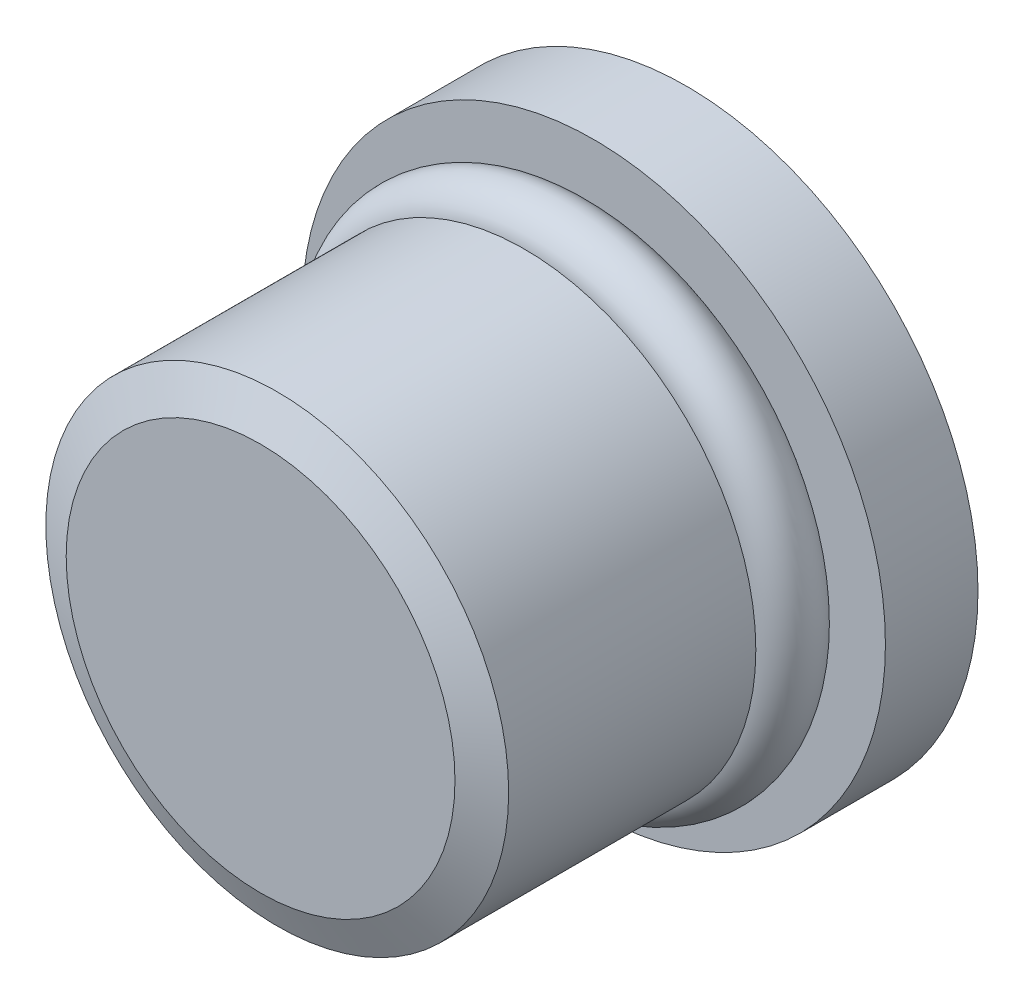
ISO-10303-21;
HEADER;
FILE_DESCRIPTION(('STEP AP214'),'2;1');
FILE_NAME('part.step','',(''),(''),'','','');
FILE_SCHEMA(('AUTOMOTIVE_DESIGN { 1 0 10303 214 1 1 1 1 }'));
ENDSEC;
DATA;
#1=APPLICATION_CONTEXT('core data for automotive mechanical design processes');
#2=APPLICATION_PROTOCOL_DEFINITION('international standard','automotive_design',2000,#1);
#3=PRODUCT_CONTEXT('',#1,'mechanical');
#4=PRODUCT('Part','Part','',(#3));
#5=PRODUCT_RELATED_PRODUCT_CATEGORY('part','',(#4));
#6=PRODUCT_DEFINITION_FORMATION('','',#4);
#7=PRODUCT_DEFINITION_CONTEXT('part definition',#1,'design');
#8=PRODUCT_DEFINITION('design','',#6,#7);
#9=PRODUCT_DEFINITION_SHAPE('','',#8);
#10=(LENGTH_UNIT() NAMED_UNIT(*) SI_UNIT(.MILLI.,.METRE.));
#11=(NAMED_UNIT(*) PLANE_ANGLE_UNIT() SI_UNIT($,.RADIAN.));
#12=(NAMED_UNIT(*) SI_UNIT($,.STERADIAN.) SOLID_ANGLE_UNIT());
#13=UNCERTAINTY_MEASURE_WITH_UNIT(LENGTH_MEASURE(1.E-05),#10,'distance_accuracy_value','');
#14=(GEOMETRIC_REPRESENTATION_CONTEXT(3) GLOBAL_UNCERTAINTY_ASSIGNED_CONTEXT((#13)) GLOBAL_UNIT_ASSIGNED_CONTEXT((#10,
#11,#12)) REPRESENTATION_CONTEXT('',''));
#15=CARTESIAN_POINT('',(0.,0.,0.));
#16=DIRECTION('',(0.,0.,1.));
#17=DIRECTION('',(1.,0.,0.));
#18=AXIS2_PLACEMENT_3D('',#15,#16,#17);
#19=CARTESIAN_POINT('',(0.,0.,3.429));
#20=DIRECTION('',(0.,0.,1.));
#21=DIRECTION('',(1.,0.,0.));
#22=AXIS2_PLACEMENT_3D('',#19,#20,#21);
#23=TOROIDAL_SURFACE('',#22,6.096,0.889);
#24=CARTESIAN_POINT('',(6.985,0.,3.429));
#25=VERTEX_POINT('',#24);
#26=VERTEX_LOOP('',#25);
#27=FACE_BOUND('',#26,.T.);
#28=ADVANCED_FACE('F41',(#27),#23,.T.);
#29=CLOSED_SHELL('',(#28));
#30=MANIFOLD_SOLID_BREP('B2',#29);
#31=CARTESIAN_POINT('',(0.,0.,11.684));
#32=DIRECTION('',(0.,0.,-1.));
#33=DIRECTION('',(-1.,0.,0.));
#34=AXIS2_PLACEMENT_3D('',#31,#32,#33);
#35=PLANE('',#34);
#36=CARTESIAN_POINT('',(0.,0.,11.684));
#37=DIRECTION('',(0.,0.,1.));
#38=DIRECTION('',(1.,0.,0.));
#39=AXIS2_PLACEMENT_3D('',#36,#37,#38);
#40=CIRCLE('',#39,5.334);
#41=CARTESIAN_POINT('',(5.334,0.,11.684));
#42=VERTEX_POINT('',#41);
#43=EDGE_CURVE('E39',#42,#42,#40,.T.);
#44=ORIENTED_EDGE('',*,*,#43,.T.);
#45=EDGE_LOOP('',(#44));
#46=FACE_BOUND('',#45,.T.);
#47=ADVANCED_FACE('F54',(#46),#35,.F.);
#48=CARTESIAN_POINT('',(0.,0.,11.2268));
#49=DIRECTION('',(0.,0.,-1.));
#50=DIRECTION('',(-1.,0.,0.));
#51=AXIS2_PLACEMENT_3D('',#48,#49,#50);
#52=CONICAL_SURFACE('',#51,6.35,1.14794240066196);
#53=ORIENTED_EDGE('',*,*,#43,.F.);
#54=EDGE_LOOP('',(#53));
#55=FACE_BOUND('',#54,.T.);
#56=CARTESIAN_POINT('',(0.,0.,11.2268));
#57=DIRECTION('',(0.,0.,1.));
#58=DIRECTION('',(1.,0.,0.));
#59=AXIS2_PLACEMENT_3D('',#56,#57,#58);
#60=CIRCLE('',#59,6.35);
#61=CARTESIAN_POINT('',(6.35,0.,11.2268));
#62=VERTEX_POINT('',#61);
#63=EDGE_CURVE('E61',#62,#62,#60,.T.);
#64=ORIENTED_EDGE('',*,*,#63,.T.);
#65=EDGE_LOOP('',(#64));
#66=FACE_BOUND('',#65,.T.);
#67=ADVANCED_FACE('F177',(#55,#66),#52,.T.);
#68=CARTESIAN_POINT('',(0.,0.,12.2682));
#69=DIRECTION('',(0.,0.,1.));
#70=DIRECTION('',(1.,0.,0.));
#71=AXIS2_PLACEMENT_3D('',#68,#69,#70);
#72=CYLINDRICAL_SURFACE('',#71,6.35);
#73=ORIENTED_EDGE('',*,*,#63,.F.);
#74=EDGE_LOOP('',(#73));
#75=FACE_BOUND('',#74,.T.);
#76=CARTESIAN_POINT('',(0.,0.,4.445));
#77=DIRECTION('',(0.,0.,1.));
#78=DIRECTION('',(1.,0.,0.));
#79=AXIS2_PLACEMENT_3D('',#76,#77,#78);
#80=CIRCLE('',#79,6.35);
#81=CARTESIAN_POINT('',(6.35,0.,4.445));
#82=VERTEX_POINT('',#81);
#83=EDGE_CURVE('E172',#82,#82,#80,.T.);
#84=ORIENTED_EDGE('',*,*,#83,.T.);
#85=EDGE_LOOP('',(#84));
#86=FACE_BOUND('',#85,.T.);
#87=ADVANCED_FACE('F179',(#75,#86),#72,.T.);
#88=CARTESIAN_POINT('',(0.,6.35,4.445));
#89=DIRECTION('',(0.,0.,1.));
#90=DIRECTION('',(1.,0.,0.));
#91=AXIS2_PLACEMENT_3D('',#88,#89,#90);
#92=PLANE('',#91);
#93=ORIENTED_EDGE('',*,*,#83,.F.);
#94=EDGE_LOOP('',(#93));
#95=FACE_BOUND('',#94,.T.);
#96=CARTESIAN_POINT('',(0.,0.,4.445));
#97=DIRECTION('',(0.,0.,1.));
#98=DIRECTION('',(1.,0.,0.));
#99=AXIS2_PLACEMENT_3D('',#96,#97,#98);
#100=CIRCLE('',#99,5.4102);
#101=CARTESIAN_POINT('',(5.4102,0.,4.445));
#102=VERTEX_POINT('',#101);
#103=EDGE_CURVE('E169',#102,#102,#100,.T.);
#104=ORIENTED_EDGE('',*,*,#103,.T.);
#105=EDGE_LOOP('',(#104));
#106=FACE_BOUND('',#105,.T.);
#107=ADVANCED_FACE('F182',(#95,#106),#92,.F.);
#108=CARTESIAN_POINT('',(0.,0.,12.2682));
#109=DIRECTION('',(0.,0.,1.));
#110=DIRECTION('',(1.,0.,0.));
#111=AXIS2_PLACEMENT_3D('',#108,#109,#110);
#112=CYLINDRICAL_SURFACE('',#111,5.4102);
#113=ORIENTED_EDGE('',*,*,#103,.F.);
#114=EDGE_LOOP('',(#113));
#115=FACE_BOUND('',#114,.T.);
#116=CARTESIAN_POINT('',(0.,0.,2.54));
#117=DIRECTION('',(0.,0.,1.));
#118=DIRECTION('',(1.,0.,0.));
#119=AXIS2_PLACEMENT_3D('',#116,#117,#118);
#120=CIRCLE('',#119,5.4102);
#121=CARTESIAN_POINT('',(5.4102,0.,2.54));
#122=VERTEX_POINT('',#121);
#123=EDGE_CURVE('E166',#122,#122,#120,.T.);
#124=ORIENTED_EDGE('',*,*,#123,.T.);
#125=EDGE_LOOP('',(#124));
#126=FACE_BOUND('',#125,.T.);
#127=ADVANCED_FACE('F188',(#115,#126),#112,.T.);
#128=CARTESIAN_POINT('',(0.,5.4102,2.54));
#129=DIRECTION('',(0.,0.,-1.));
#130=DIRECTION('',(-1.,0.,0.));
#131=AXIS2_PLACEMENT_3D('',#128,#129,#130);
#132=PLANE('',#131);
#133=ORIENTED_EDGE('',*,*,#123,.F.);
#134=EDGE_LOOP('',(#133));
#135=FACE_BOUND('',#134,.T.);
#136=CARTESIAN_POINT('',(0.,0.,2.54));
#137=DIRECTION('',(0.,0.,1.));
#138=DIRECTION('',(1.,0.,0.));
#139=AXIS2_PLACEMENT_3D('',#136,#137,#138);
#140=CIRCLE('',#139,8.001);
#141=CARTESIAN_POINT('',(8.001,0.,2.54));
#142=VERTEX_POINT('',#141);
#143=EDGE_CURVE('E163',#142,#142,#140,.T.);
#144=ORIENTED_EDGE('',*,*,#143,.T.);
#145=EDGE_LOOP('',(#144));
#146=FACE_BOUND('',#145,.T.);
#147=ADVANCED_FACE('F194',(#135,#146),#132,.F.);
#148=CARTESIAN_POINT('',(0.,0.,12.2682));
#149=DIRECTION('',(0.,0.,1.));
#150=DIRECTION('',(1.,0.,0.));
#151=AXIS2_PLACEMENT_3D('',#148,#149,#150);
#152=CYLINDRICAL_SURFACE('',#151,8.001);
#153=ORIENTED_EDGE('',*,*,#143,.F.);
#154=EDGE_LOOP('',(#153));
#155=FACE_BOUND('',#154,.T.);
#156=CARTESIAN_POINT('',(0.,0.,0.));
#157=DIRECTION('',(0.,0.,1.));
#158=DIRECTION('',(1.,0.,0.));
#159=AXIS2_PLACEMENT_3D('',#156,#157,#158);
#160=CIRCLE('',#159,8.001);
#161=CARTESIAN_POINT('',(8.001,0.,0.));
#162=VERTEX_POINT('',#161);
#163=EDGE_CURVE('E155',#162,#162,#160,.T.);
#164=ORIENTED_EDGE('',*,*,#163,.T.);
#165=EDGE_LOOP('',(#164));
#166=FACE_BOUND('',#165,.T.);
#167=ADVANCED_FACE('F200',(#155,#166),#152,.T.);
#168=CARTESIAN_POINT('',(0.,8.001,0.));
#169=DIRECTION('',(0.,0.,1.));
#170=DIRECTION('',(1.,0.,0.));
#171=AXIS2_PLACEMENT_3D('',#168,#169,#170);
#172=PLANE('',#171);
#173=DIRECTION('',(-0.866025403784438,0.5,0.));
#174=VECTOR('',#173,1.);
#175=CARTESIAN_POINT('',(-2.38125,-1.3748153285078,0.));
#176=LINE('',#175,#174);
#177=CARTESIAN_POINT('',(0.,-2.74963065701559,0.));
#178=VERTEX_POINT('',#177);
#179=CARTESIAN_POINT('',(-2.38125,-1.3748153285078,0.));
#180=VERTEX_POINT('',#179);
#181=EDGE_CURVE('E142',#178,#180,#176,.T.);
#182=ORIENTED_EDGE('',*,*,#181,.F.);
#183=DIRECTION('',(-0.866025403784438,-0.5,0.));
#184=VECTOR('',#183,1.);
#185=CARTESIAN_POINT('',(0.,-2.7496306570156,0.));
#186=LINE('',#185,#184);
#187=CARTESIAN_POINT('',(2.38125,-1.3748153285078,0.));
#188=VERTEX_POINT('',#187);
#189=EDGE_CURVE('E68',#188,#178,#186,.T.);
#190=ORIENTED_EDGE('',*,*,#189,.F.);
#191=DIRECTION('',(0.,-1.,0.));
#192=VECTOR('',#191,1.);
#193=CARTESIAN_POINT('',(2.38125,-1.3748153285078,0.));
#194=LINE('',#193,#192);
#195=CARTESIAN_POINT('',(2.38125,1.3748153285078,0.));
#196=VERTEX_POINT('',#195);
#197=EDGE_CURVE('E151',#196,#188,#194,.T.);
#198=ORIENTED_EDGE('',*,*,#197,.F.);
#199=DIRECTION('',(0.866025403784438,-0.5,0.));
#200=VECTOR('',#199,1.);
#201=CARTESIAN_POINT('',(2.38125,1.3748153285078,0.));
#202=LINE('',#201,#200);
#203=CARTESIAN_POINT('',(0.,2.7496306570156,0.));
#204=VERTEX_POINT('',#203);
#205=EDGE_CURVE('E149',#204,#196,#202,.T.);
#206=ORIENTED_EDGE('',*,*,#205,.F.);
#207=DIRECTION('',(0.866025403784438,0.5,0.));
#208=VECTOR('',#207,1.);
#209=CARTESIAN_POINT('',(0.,2.7496306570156,0.));
#210=LINE('',#209,#208);
#211=CARTESIAN_POINT('',(-2.38125,1.3748153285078,0.));
#212=VERTEX_POINT('',#211);
#213=EDGE_CURVE('E116',#212,#204,#210,.T.);
#214=ORIENTED_EDGE('',*,*,#213,.F.);
#215=DIRECTION('',(0.,1.,0.));
#216=VECTOR('',#215,1.);
#217=CARTESIAN_POINT('',(-2.38125,1.3748153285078,0.));
#218=LINE('',#217,#216);
#219=EDGE_CURVE('E145',#180,#212,#218,.T.);
#220=ORIENTED_EDGE('',*,*,#219,.F.);
#221=EDGE_LOOP('',(#182,#190,#198,#206,#214,#220));
#222=FACE_BOUND('',#221,.T.);
#223=ORIENTED_EDGE('',*,*,#163,.F.);
#224=EDGE_LOOP('',(#223));
#225=FACE_BOUND('',#224,.T.);
#226=ADVANCED_FACE('F206',(#222,#225),#172,.F.);
#227=CARTESIAN_POINT('',(0.,-2.7496306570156,4.6736));
#228=DIRECTION('',(0.5,-0.866025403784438,0.));
#229=DIRECTION('',(0.866025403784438,0.500000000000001,0.));
#230=AXIS2_PLACEMENT_3D('',#227,#228,#229);
#231=PLANE('',#230);
#232=ORIENTED_EDGE('',*,*,#189,.T.);
#233=DIRECTION('',(0.,0.,-1.));
#234=VECTOR('',#233,1.);
#235=CARTESIAN_POINT('',(0.,-2.7496306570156,4.6736));
#236=LINE('',#235,#234);
#237=CARTESIAN_POINT('',(0.,-2.7496306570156,4.6736));
#238=VERTEX_POINT('',#237);
#239=EDGE_CURVE('E98',#238,#178,#236,.T.);
#240=ORIENTED_EDGE('',*,*,#239,.F.);
#241=DIRECTION('',(-0.866025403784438,-0.5,0.));
#242=VECTOR('',#241,1.);
#243=CARTESIAN_POINT('',(0.,-2.7496306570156,4.6736));
#244=LINE('',#243,#242);
#245=CARTESIAN_POINT('',(2.38125,-1.3748153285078,4.6736));
#246=VERTEX_POINT('',#245);
#247=EDGE_CURVE('E153',#246,#238,#244,.T.);
#248=ORIENTED_EDGE('',*,*,#247,.F.);
#249=DIRECTION('',(0.,0.,-1.));
#250=VECTOR('',#249,1.);
#251=CARTESIAN_POINT('',(2.38125,-1.3748153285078,4.6736));
#252=LINE('',#251,#250);
#253=EDGE_CURVE('E76',#246,#188,#252,.T.);
#254=ORIENTED_EDGE('',*,*,#253,.T.);
#255=EDGE_LOOP('',(#232,#240,#248,#254));
#256=FACE_BOUND('',#255,.T.);
#257=ADVANCED_FACE('F211',(#256),#231,.F.);
#258=CARTESIAN_POINT('',(2.38125,-1.3748153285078,4.6736));
#259=DIRECTION('',(1.,0.,0.));
#260=DIRECTION('',(0.,0.,-1.));
#261=AXIS2_PLACEMENT_3D('',#258,#259,#260);
#262=PLANE('',#261);
#263=ORIENTED_EDGE('',*,*,#197,.T.);
#264=ORIENTED_EDGE('',*,*,#253,.F.);
#265=DIRECTION('',(0.,-1.,0.));
#266=VECTOR('',#265,1.);
#267=CARTESIAN_POINT('',(2.38125,-1.3748153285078,4.6736));
#268=LINE('',#267,#266);
#269=CARTESIAN_POINT('',(2.38125,1.3748153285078,4.6736));
#270=VERTEX_POINT('',#269);
#271=EDGE_CURVE('E128',#270,#246,#268,.T.);
#272=ORIENTED_EDGE('',*,*,#271,.F.);
#273=DIRECTION('',(0.,0.,-1.));
#274=VECTOR('',#273,1.);
#275=CARTESIAN_POINT('',(2.38125,1.3748153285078,4.6736));
#276=LINE('',#275,#274);
#277=EDGE_CURVE('E120',#270,#196,#276,.T.);
#278=ORIENTED_EDGE('',*,*,#277,.T.);
#279=EDGE_LOOP('',(#263,#264,#272,#278));
#280=FACE_BOUND('',#279,.T.);
#281=ADVANCED_FACE('F217',(#280),#262,.F.);
#282=CARTESIAN_POINT('',(2.38125,1.3748153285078,4.6736));
#283=DIRECTION('',(0.5,0.866025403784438,0.));
#284=DIRECTION('',(-0.866025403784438,0.500000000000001,0.));
#285=AXIS2_PLACEMENT_3D('',#282,#283,#284);
#286=PLANE('',#285);
#287=ORIENTED_EDGE('',*,*,#205,.T.);
#288=ORIENTED_EDGE('',*,*,#277,.F.);
#289=DIRECTION('',(0.866025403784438,-0.5,0.));
#290=VECTOR('',#289,1.);
#291=CARTESIAN_POINT('',(2.38125,1.3748153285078,4.6736));
#292=LINE('',#291,#290);
#293=CARTESIAN_POINT('',(0.,2.7496306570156,4.6736));
#294=VERTEX_POINT('',#293);
#295=EDGE_CURVE('E124',#294,#270,#292,.T.);
#296=ORIENTED_EDGE('',*,*,#295,.F.);
#297=DIRECTION('',(0.,0.,-1.));
#298=VECTOR('',#297,1.);
#299=CARTESIAN_POINT('',(0.,2.7496306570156,4.6736));
#300=LINE('',#299,#298);
#301=EDGE_CURVE('E109',#294,#204,#300,.T.);
#302=ORIENTED_EDGE('',*,*,#301,.T.);
#303=EDGE_LOOP('',(#287,#288,#296,#302));
#304=FACE_BOUND('',#303,.T.);
#305=ADVANCED_FACE('F125',(#304),#286,.F.);
#306=CARTESIAN_POINT('',(0.,2.7496306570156,4.6736));
#307=DIRECTION('',(-0.5,0.866025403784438,0.));
#308=DIRECTION('',(-0.866025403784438,-0.500000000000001,0.));
#309=AXIS2_PLACEMENT_3D('',#306,#307,#308);
#310=PLANE('',#309);
#311=ORIENTED_EDGE('',*,*,#213,.T.);
#312=ORIENTED_EDGE('',*,*,#301,.F.);
#313=DIRECTION('',(0.866025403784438,0.5,0.));
#314=VECTOR('',#313,1.);
#315=CARTESIAN_POINT('',(0.,2.7496306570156,4.6736));
#316=LINE('',#315,#314);
#317=CARTESIAN_POINT('',(-2.38125,1.3748153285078,4.6736));
#318=VERTEX_POINT('',#317);
#319=EDGE_CURVE('E113',#318,#294,#316,.T.);
#320=ORIENTED_EDGE('',*,*,#319,.F.);
#321=DIRECTION('',(0.,0.,-1.));
#322=VECTOR('',#321,1.);
#323=CARTESIAN_POINT('',(-2.38125,1.3748153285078,4.6736));
#324=LINE('',#323,#322);
#325=EDGE_CURVE('E121',#318,#212,#324,.T.);
#326=ORIENTED_EDGE('',*,*,#325,.T.);
#327=EDGE_LOOP('',(#311,#312,#320,#326));
#328=FACE_BOUND('',#327,.T.);
#329=ADVANCED_FACE('F111',(#328),#310,.F.);
#330=CARTESIAN_POINT('',(-2.38125,1.3748153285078,4.6736));
#331=DIRECTION('',(-1.,0.,0.));
#332=DIRECTION('',(0.,0.,1.));
#333=AXIS2_PLACEMENT_3D('',#330,#331,#332);
#334=PLANE('',#333);
#335=ORIENTED_EDGE('',*,*,#219,.T.);
#336=ORIENTED_EDGE('',*,*,#325,.F.);
#337=DIRECTION('',(0.,1.,0.));
#338=VECTOR('',#337,1.);
#339=CARTESIAN_POINT('',(-2.38125,1.3748153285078,4.6736));
#340=LINE('',#339,#338);
#341=CARTESIAN_POINT('',(-2.38125,-1.3748153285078,4.6736));
#342=VERTEX_POINT('',#341);
#343=EDGE_CURVE('E134',#342,#318,#340,.T.);
#344=ORIENTED_EDGE('',*,*,#343,.F.);
#345=DIRECTION('',(0.,0.,-1.));
#346=VECTOR('',#345,1.);
#347=CARTESIAN_POINT('',(-2.38125,-1.3748153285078,4.6736));
#348=LINE('',#347,#346);
#349=EDGE_CURVE('E158',#342,#180,#348,.T.);
#350=ORIENTED_EDGE('',*,*,#349,.T.);
#351=EDGE_LOOP('',(#335,#336,#344,#350));
#352=FACE_BOUND('',#351,.T.);
#353=ADVANCED_FACE('F284',(#352),#334,.F.);
#354=CARTESIAN_POINT('',(-2.38125,-1.3748153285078,4.6736));
#355=DIRECTION('',(-0.5,-0.866025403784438,0.));
#356=DIRECTION('',(0.866025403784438,-0.500000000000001,0.));
#357=AXIS2_PLACEMENT_3D('',#354,#355,#356);
#358=PLANE('',#357);
#359=ORIENTED_EDGE('',*,*,#181,.T.);
#360=ORIENTED_EDGE('',*,*,#349,.F.);
#361=DIRECTION('',(-0.866025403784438,0.5,0.));
#362=VECTOR('',#361,1.);
#363=CARTESIAN_POINT('',(-2.38125,-1.3748153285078,4.6736));
#364=LINE('',#363,#362);
#365=EDGE_CURVE('E136',#238,#342,#364,.T.);
#366=ORIENTED_EDGE('',*,*,#365,.F.);
#367=ORIENTED_EDGE('',*,*,#239,.T.);
#368=EDGE_LOOP('',(#359,#360,#366,#367));
#369=FACE_BOUND('',#368,.T.);
#370=ADVANCED_FACE('F293',(#369),#358,.F.);
#371=CARTESIAN_POINT('',(0.,0.,4.6736));
#372=DIRECTION('',(0.,0.,1.));
#373=DIRECTION('',(1.,0.,0.));
#374=AXIS2_PLACEMENT_3D('',#371,#372,#373);
#375=PLANE('',#374);
#376=ORIENTED_EDGE('',*,*,#247,.T.);
#377=ORIENTED_EDGE('',*,*,#365,.T.);
#378=ORIENTED_EDGE('',*,*,#343,.T.);
#379=ORIENTED_EDGE('',*,*,#319,.T.);
#380=ORIENTED_EDGE('',*,*,#295,.T.);
#381=ORIENTED_EDGE('',*,*,#271,.T.);
#382=EDGE_LOOP('',(#376,#377,#378,#379,#380,#381));
#383=FACE_BOUND('',#382,.T.);
#384=ADVANCED_FACE('F131',(#383),#375,.F.);
#385=CLOSED_SHELL('',(#47,#67,#87,#107,#127,#147,#167,#226,#257,#281,#305,#329,#353,#370,#384));
#386=MANIFOLD_SOLID_BREP('B6',#385);
#387=ADVANCED_BREP_SHAPE_REPRESENTATION('',(#18,#30,#386),#14);
#388=SHAPE_DEFINITION_REPRESENTATION(#9,#387);
ENDSEC;
END-ISO-10303-21;
